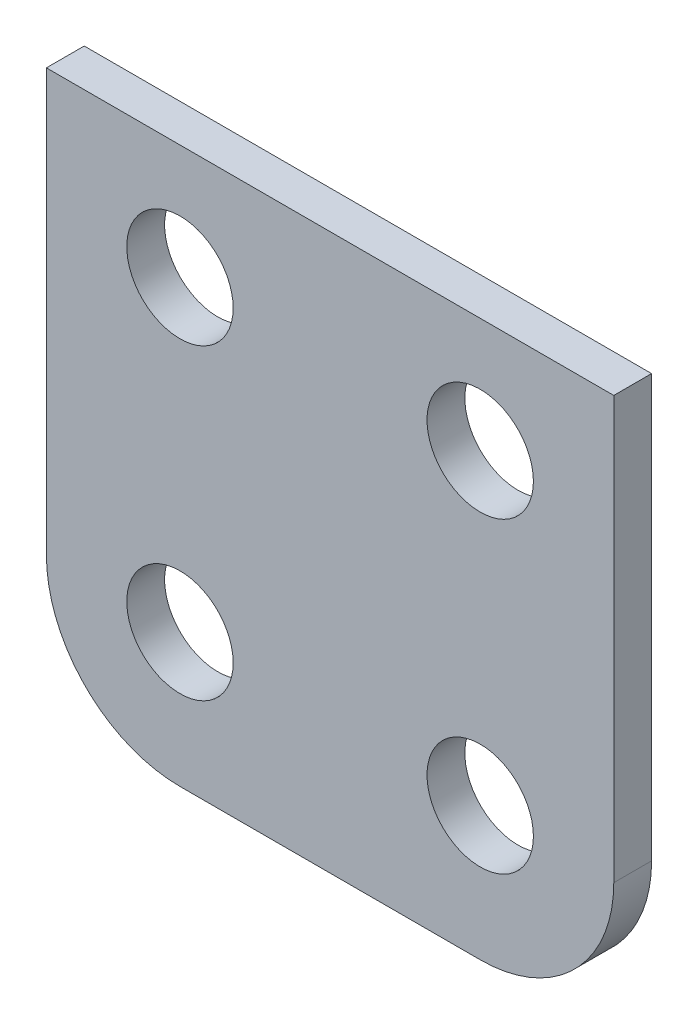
ISO-10303-21;
HEADER;
FILE_DESCRIPTION(('STEP AP214'),'2;1');
FILE_NAME('part.step','',(''),(''),'','','');
FILE_SCHEMA(('AUTOMOTIVE_DESIGN { 1 0 10303 214 1 1 1 1 }'));
ENDSEC;
DATA;
#1=APPLICATION_CONTEXT('core data for automotive mechanical design processes');
#2=APPLICATION_PROTOCOL_DEFINITION('international standard','automotive_design',2000,#1);
#3=PRODUCT_CONTEXT('',#1,'mechanical');
#4=PRODUCT('Part','Part','',(#3));
#5=PRODUCT_RELATED_PRODUCT_CATEGORY('part','',(#4));
#6=PRODUCT_DEFINITION_FORMATION('','',#4);
#7=PRODUCT_DEFINITION_CONTEXT('part definition',#1,'design');
#8=PRODUCT_DEFINITION('design','',#6,#7);
#9=PRODUCT_DEFINITION_SHAPE('','',#8);
#10=(LENGTH_UNIT() NAMED_UNIT(*) SI_UNIT(.MILLI.,.METRE.));
#11=(NAMED_UNIT(*) PLANE_ANGLE_UNIT() SI_UNIT($,.RADIAN.));
#12=(NAMED_UNIT(*) SI_UNIT($,.STERADIAN.) SOLID_ANGLE_UNIT());
#13=UNCERTAINTY_MEASURE_WITH_UNIT(LENGTH_MEASURE(1.E-05),#10,'distance_accuracy_value','');
#14=(GEOMETRIC_REPRESENTATION_CONTEXT(3) GLOBAL_UNCERTAINTY_ASSIGNED_CONTEXT((#13)) GLOBAL_UNIT_ASSIGNED_CONTEXT((#10,
#11,#12)) REPRESENTATION_CONTEXT('',''));
#15=CARTESIAN_POINT('',(0.,0.,0.));
#16=DIRECTION('',(0.,0.,1.));
#17=DIRECTION('',(1.,0.,0.));
#18=AXIS2_PLACEMENT_3D('',#15,#16,#17);
#19=CARTESIAN_POINT('',(24.,23.5,1.6));
#20=DIRECTION('',(0.,-1.,0.));
#21=DIRECTION('',(0.,0.,-1.));
#22=AXIS2_PLACEMENT_3D('',#19,#20,#21);
#23=PLANE('',#22);
#24=DIRECTION('',(-1.,0.,0.));
#25=VECTOR('',#24,1.);
#26=CARTESIAN_POINT('',(24.,23.5,0.));
#27=LINE('',#26,#25);
#28=CARTESIAN_POINT('',(24.,23.5,0.));
#29=VERTEX_POINT('',#28);
#30=CARTESIAN_POINT('',(0.,23.5,0.));
#31=VERTEX_POINT('',#30);
#32=EDGE_CURVE('E115',#29,#31,#27,.T.);
#33=ORIENTED_EDGE('',*,*,#32,.T.);
#34=DIRECTION('',(0.,0.,-1.));
#35=VECTOR('',#34,1.);
#36=CARTESIAN_POINT('',(0.,23.5,1.6));
#37=LINE('',#36,#35);
#38=CARTESIAN_POINT('',(0.,23.5,1.6));
#39=VERTEX_POINT('',#38);
#40=EDGE_CURVE('E11',#39,#31,#37,.T.);
#41=ORIENTED_EDGE('',*,*,#40,.F.);
#42=DIRECTION('',(-1.,0.,0.));
#43=VECTOR('',#42,1.);
#44=CARTESIAN_POINT('',(24.,23.5,1.6));
#45=LINE('',#44,#43);
#46=CARTESIAN_POINT('',(24.,23.5,1.6));
#47=VERTEX_POINT('',#46);
#48=EDGE_CURVE('E126',#47,#39,#45,.T.);
#49=ORIENTED_EDGE('',*,*,#48,.F.);
#50=DIRECTION('',(0.,0.,-1.));
#51=VECTOR('',#50,1.);
#52=CARTESIAN_POINT('',(24.,23.5,1.6));
#53=LINE('',#52,#51);
#54=EDGE_CURVE('E111',#47,#29,#53,.T.);
#55=ORIENTED_EDGE('',*,*,#54,.T.);
#56=EDGE_LOOP('',(#33,#41,#49,#55));
#57=FACE_BOUND('',#56,.T.);
#58=ADVANCED_FACE('F31',(#57),#23,.F.);
#59=CARTESIAN_POINT('',(0.,23.5,1.6));
#60=DIRECTION('',(1.,0.,0.));
#61=DIRECTION('',(0.,1.,0.));
#62=AXIS2_PLACEMENT_3D('',#59,#60,#61);
#63=PLANE('',#62);
#64=DIRECTION('',(0.,-1.,0.));
#65=VECTOR('',#64,1.);
#66=CARTESIAN_POINT('',(0.,23.5,0.));
#67=LINE('',#66,#65);
#68=CARTESIAN_POINT('',(0.,5.65,0.));
#69=VERTEX_POINT('',#68);
#70=EDGE_CURVE('E118',#31,#69,#67,.T.);
#71=ORIENTED_EDGE('',*,*,#70,.T.);
#72=DIRECTION('',(0.,0.,-1.));
#73=VECTOR('',#72,1.);
#74=CARTESIAN_POINT('',(0.,5.65,1.6));
#75=LINE('',#74,#73);
#76=CARTESIAN_POINT('',(0.,5.65,1.6));
#77=VERTEX_POINT('',#76);
#78=EDGE_CURVE('E39',#77,#69,#75,.T.);
#79=ORIENTED_EDGE('',*,*,#78,.F.);
#80=DIRECTION('',(0.,-1.,0.));
#81=VECTOR('',#80,1.);
#82=CARTESIAN_POINT('',(0.,23.5,1.6));
#83=LINE('',#82,#81);
#84=EDGE_CURVE('E84',#39,#77,#83,.T.);
#85=ORIENTED_EDGE('',*,*,#84,.F.);
#86=ORIENTED_EDGE('',*,*,#40,.T.);
#87=EDGE_LOOP('',(#71,#79,#85,#86));
#88=FACE_BOUND('',#87,.T.);
#89=ADVANCED_FACE('F151',(#88),#63,.F.);
#90=CARTESIAN_POINT('',(5.65,5.65,1.6));
#91=DIRECTION('',(0.,0.,-1.));
#92=DIRECTION('',(-1.,0.,0.));
#93=AXIS2_PLACEMENT_3D('',#90,#91,#92);
#94=CYLINDRICAL_SURFACE('',#93,5.65);
#95=CARTESIAN_POINT('',(5.65,5.65,0.));
#96=DIRECTION('',(0.,0.,1.));
#97=DIRECTION('',(-1.,0.,0.));
#98=AXIS2_PLACEMENT_3D('',#95,#96,#97);
#99=CIRCLE('',#98,5.65);
#100=CARTESIAN_POINT('',(5.65,0.,0.));
#101=VERTEX_POINT('',#100);
#102=EDGE_CURVE('E121',#69,#101,#99,.T.);
#103=ORIENTED_EDGE('',*,*,#102,.T.);
#104=DIRECTION('',(0.,0.,-1.));
#105=VECTOR('',#104,1.);
#106=CARTESIAN_POINT('',(5.65,0.,1.6));
#107=LINE('',#106,#105);
#108=CARTESIAN_POINT('',(5.65,0.,1.6));
#109=VERTEX_POINT('',#108);
#110=EDGE_CURVE('E106',#109,#101,#107,.T.);
#111=ORIENTED_EDGE('',*,*,#110,.F.);
#112=CARTESIAN_POINT('',(5.65,5.65,1.6));
#113=DIRECTION('',(0.,0.,1.));
#114=DIRECTION('',(-1.,0.,0.));
#115=AXIS2_PLACEMENT_3D('',#112,#113,#114);
#116=CIRCLE('',#115,5.65);
#117=EDGE_CURVE('E97',#77,#109,#116,.T.);
#118=ORIENTED_EDGE('',*,*,#117,.F.);
#119=ORIENTED_EDGE('',*,*,#78,.T.);
#120=EDGE_LOOP('',(#103,#111,#118,#119));
#121=FACE_BOUND('',#120,.T.);
#122=ADVANCED_FACE('F132',(#121),#94,.T.);
#123=CARTESIAN_POINT('',(5.65,0.,1.6));
#124=DIRECTION('',(0.,1.,0.));
#125=DIRECTION('',(0.,0.,1.));
#126=AXIS2_PLACEMENT_3D('',#123,#124,#125);
#127=PLANE('',#126);
#128=DIRECTION('',(1.,0.,0.));
#129=VECTOR('',#128,1.);
#130=CARTESIAN_POINT('',(5.65,0.,0.));
#131=LINE('',#130,#129);
#132=CARTESIAN_POINT('',(18.35,0.,0.));
#133=VERTEX_POINT('',#132);
#134=EDGE_CURVE('E105',#101,#133,#131,.T.);
#135=ORIENTED_EDGE('',*,*,#134,.T.);
#136=DIRECTION('',(0.,0.,-1.));
#137=VECTOR('',#136,1.);
#138=CARTESIAN_POINT('',(18.35,0.,1.6));
#139=LINE('',#138,#137);
#140=CARTESIAN_POINT('',(18.35,0.,1.6));
#141=VERTEX_POINT('',#140);
#142=EDGE_CURVE('E102',#141,#133,#139,.T.);
#143=ORIENTED_EDGE('',*,*,#142,.F.);
#144=DIRECTION('',(1.,0.,0.));
#145=VECTOR('',#144,1.);
#146=CARTESIAN_POINT('',(5.65,0.,1.6));
#147=LINE('',#146,#145);
#148=EDGE_CURVE('E91',#109,#141,#147,.T.);
#149=ORIENTED_EDGE('',*,*,#148,.F.);
#150=ORIENTED_EDGE('',*,*,#110,.T.);
#151=EDGE_LOOP('',(#135,#143,#149,#150));
#152=FACE_BOUND('',#151,.T.);
#153=ADVANCED_FACE('F103',(#152),#127,.F.);
#154=CARTESIAN_POINT('',(18.35,5.65,1.6));
#155=DIRECTION('',(0.,0.,-1.));
#156=DIRECTION('',(-1.,0.,0.));
#157=AXIS2_PLACEMENT_3D('',#154,#155,#156);
#158=CYLINDRICAL_SURFACE('',#157,5.65);
#159=CARTESIAN_POINT('',(18.35,5.65,0.));
#160=DIRECTION('',(0.,0.,1.));
#161=DIRECTION('',(-1.,0.,0.));
#162=AXIS2_PLACEMENT_3D('',#159,#160,#161);
#163=CIRCLE('',#162,5.65);
#164=CARTESIAN_POINT('',(24.,5.65,0.));
#165=VERTEX_POINT('',#164);
#166=EDGE_CURVE('E70',#133,#165,#163,.T.);
#167=ORIENTED_EDGE('',*,*,#166,.T.);
#168=DIRECTION('',(0.,0.,-1.));
#169=VECTOR('',#168,1.);
#170=CARTESIAN_POINT('',(24.,5.65,1.6));
#171=LINE('',#170,#169);
#172=CARTESIAN_POINT('',(24.,5.65,1.6));
#173=VERTEX_POINT('',#172);
#174=EDGE_CURVE('E107',#173,#165,#171,.T.);
#175=ORIENTED_EDGE('',*,*,#174,.F.);
#176=CARTESIAN_POINT('',(18.35,5.65,1.6));
#177=DIRECTION('',(0.,0.,1.));
#178=DIRECTION('',(-1.,0.,0.));
#179=AXIS2_PLACEMENT_3D('',#176,#177,#178);
#180=CIRCLE('',#179,5.65);
#181=EDGE_CURVE('E95',#141,#173,#180,.T.);
#182=ORIENTED_EDGE('',*,*,#181,.F.);
#183=ORIENTED_EDGE('',*,*,#142,.T.);
#184=EDGE_LOOP('',(#167,#175,#182,#183));
#185=FACE_BOUND('',#184,.T.);
#186=ADVANCED_FACE('F109',(#185),#158,.T.);
#187=CARTESIAN_POINT('',(24.,5.65,1.6));
#188=DIRECTION('',(-1.,0.,0.));
#189=DIRECTION('',(0.,-1.,0.));
#190=AXIS2_PLACEMENT_3D('',#187,#188,#189);
#191=PLANE('',#190);
#192=DIRECTION('',(0.,1.,0.));
#193=VECTOR('',#192,1.);
#194=CARTESIAN_POINT('',(24.,5.65,0.));
#195=LINE('',#194,#193);
#196=EDGE_CURVE('E76',#165,#29,#195,.T.);
#197=ORIENTED_EDGE('',*,*,#196,.T.);
#198=ORIENTED_EDGE('',*,*,#54,.F.);
#199=DIRECTION('',(0.,1.,0.));
#200=VECTOR('',#199,1.);
#201=CARTESIAN_POINT('',(24.,5.65,1.6));
#202=LINE('',#201,#200);
#203=EDGE_CURVE('E47',#173,#47,#202,.T.);
#204=ORIENTED_EDGE('',*,*,#203,.F.);
#205=ORIENTED_EDGE('',*,*,#174,.T.);
#206=EDGE_LOOP('',(#197,#198,#204,#205));
#207=FACE_BOUND('',#206,.T.);
#208=ADVANCED_FACE('F139',(#207),#191,.F.);
#209=CARTESIAN_POINT('',(5.65,5.65,1.6));
#210=DIRECTION('',(0.,0.,-1.));
#211=DIRECTION('',(-1.,0.,0.));
#212=AXIS2_PLACEMENT_3D('',#209,#210,#211);
#213=PLANE('',#212);
#214=CARTESIAN_POINT('',(5.65,5.65,1.6));
#215=DIRECTION('',(0.,0.,1.));
#216=DIRECTION('',(1.,0.,0.));
#217=AXIS2_PLACEMENT_3D('',#214,#215,#216);
#218=CIRCLE('',#217,2.24999999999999);
#219=CARTESIAN_POINT('',(7.89999999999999,5.65,1.6));
#220=VERTEX_POINT('',#219);
#221=EDGE_CURVE('E237',#220,#220,#218,.T.);
#222=ORIENTED_EDGE('',*,*,#221,.F.);
#223=EDGE_LOOP('',(#222));
#224=FACE_BOUND('',#223,.T.);
#225=CARTESIAN_POINT('',(18.35,5.65,1.6));
#226=DIRECTION('',(0.,0.,1.));
#227=DIRECTION('',(1.,0.,0.));
#228=AXIS2_PLACEMENT_3D('',#225,#226,#227);
#229=CIRCLE('',#228,2.24999999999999);
#230=CARTESIAN_POINT('',(20.6,5.65,1.6));
#231=VERTEX_POINT('',#230);
#232=EDGE_CURVE('E239',#231,#231,#229,.T.);
#233=ORIENTED_EDGE('',*,*,#232,.F.);
#234=EDGE_LOOP('',(#233));
#235=FACE_BOUND('',#234,.T.);
#236=CARTESIAN_POINT('',(18.35,18.65,1.6));
#237=DIRECTION('',(0.,0.,1.));
#238=DIRECTION('',(1.,0.,0.));
#239=AXIS2_PLACEMENT_3D('',#236,#237,#238);
#240=CIRCLE('',#239,2.24999999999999);
#241=CARTESIAN_POINT('',(20.6,18.65,1.6));
#242=VERTEX_POINT('',#241);
#243=EDGE_CURVE('E247',#242,#242,#240,.T.);
#244=ORIENTED_EDGE('',*,*,#243,.F.);
#245=EDGE_LOOP('',(#244));
#246=FACE_BOUND('',#245,.T.);
#247=CARTESIAN_POINT('',(5.65,18.65,1.6));
#248=DIRECTION('',(0.,0.,1.));
#249=DIRECTION('',(1.,0.,0.));
#250=AXIS2_PLACEMENT_3D('',#247,#248,#249);
#251=CIRCLE('',#250,2.24999999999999);
#252=CARTESIAN_POINT('',(7.89999999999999,18.65,1.6));
#253=VERTEX_POINT('',#252);
#254=EDGE_CURVE('E253',#253,#253,#251,.T.);
#255=ORIENTED_EDGE('',*,*,#254,.F.);
#256=EDGE_LOOP('',(#255));
#257=FACE_BOUND('',#256,.T.);
#258=ORIENTED_EDGE('',*,*,#48,.T.);
#259=ORIENTED_EDGE('',*,*,#84,.T.);
#260=ORIENTED_EDGE('',*,*,#117,.T.);
#261=ORIENTED_EDGE('',*,*,#148,.T.);
#262=ORIENTED_EDGE('',*,*,#181,.T.);
#263=ORIENTED_EDGE('',*,*,#203,.T.);
#264=EDGE_LOOP('',(#258,#259,#260,#261,#262,#263));
#265=FACE_BOUND('',#264,.T.);
#266=ADVANCED_FACE('F93',(#224,#235,#246,#257,#265),#213,.F.);
#267=CARTESIAN_POINT('',(5.65,5.65,0.));
#268=DIRECTION('',(0.,0.,-1.));
#269=DIRECTION('',(-1.,0.,0.));
#270=AXIS2_PLACEMENT_3D('',#267,#268,#269);
#271=PLANE('',#270);
#272=CARTESIAN_POINT('',(5.65,5.65,0.));
#273=DIRECTION('',(0.,0.,1.));
#274=DIRECTION('',(1.,0.,0.));
#275=AXIS2_PLACEMENT_3D('',#272,#273,#274);
#276=CIRCLE('',#275,2.24999999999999);
#277=CARTESIAN_POINT('',(7.89999999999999,5.65,0.));
#278=VERTEX_POINT('',#277);
#279=EDGE_CURVE('E234',#278,#278,#276,.T.);
#280=ORIENTED_EDGE('',*,*,#279,.T.);
#281=EDGE_LOOP('',(#280));
#282=FACE_BOUND('',#281,.T.);
#283=CARTESIAN_POINT('',(18.35,5.65,0.));
#284=DIRECTION('',(0.,0.,1.));
#285=DIRECTION('',(1.,0.,0.));
#286=AXIS2_PLACEMENT_3D('',#283,#284,#285);
#287=CIRCLE('',#286,2.24999999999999);
#288=CARTESIAN_POINT('',(20.6,5.65,0.));
#289=VERTEX_POINT('',#288);
#290=EDGE_CURVE('E244',#289,#289,#287,.T.);
#291=ORIENTED_EDGE('',*,*,#290,.T.);
#292=EDGE_LOOP('',(#291));
#293=FACE_BOUND('',#292,.T.);
#294=CARTESIAN_POINT('',(18.35,18.65,0.));
#295=DIRECTION('',(0.,0.,1.));
#296=DIRECTION('',(1.,0.,0.));
#297=AXIS2_PLACEMENT_3D('',#294,#295,#296);
#298=CIRCLE('',#297,2.24999999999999);
#299=CARTESIAN_POINT('',(20.6,18.65,0.));
#300=VERTEX_POINT('',#299);
#301=EDGE_CURVE('E250',#300,#300,#298,.T.);
#302=ORIENTED_EDGE('',*,*,#301,.T.);
#303=EDGE_LOOP('',(#302));
#304=FACE_BOUND('',#303,.T.);
#305=CARTESIAN_POINT('',(5.65,18.65,0.));
#306=DIRECTION('',(0.,0.,1.));
#307=DIRECTION('',(1.,0.,0.));
#308=AXIS2_PLACEMENT_3D('',#305,#306,#307);
#309=CIRCLE('',#308,2.24999999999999);
#310=CARTESIAN_POINT('',(7.89999999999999,18.65,0.));
#311=VERTEX_POINT('',#310);
#312=EDGE_CURVE('E119',#311,#311,#309,.T.);
#313=ORIENTED_EDGE('',*,*,#312,.T.);
#314=EDGE_LOOP('',(#313));
#315=FACE_BOUND('',#314,.T.);
#316=ORIENTED_EDGE('',*,*,#32,.F.);
#317=ORIENTED_EDGE('',*,*,#196,.F.);
#318=ORIENTED_EDGE('',*,*,#166,.F.);
#319=ORIENTED_EDGE('',*,*,#134,.F.);
#320=ORIENTED_EDGE('',*,*,#102,.F.);
#321=ORIENTED_EDGE('',*,*,#70,.F.);
#322=EDGE_LOOP('',(#316,#317,#318,#319,#320,#321));
#323=FACE_BOUND('',#322,.T.);
#324=ADVANCED_FACE('F135',(#282,#293,#304,#315,#323),#271,.T.);
#325=CARTESIAN_POINT('',(5.65,18.65,1.6));
#326=DIRECTION('',(0.,0.,1.));
#327=DIRECTION('',(1.,0.,0.));
#328=AXIS2_PLACEMENT_3D('',#325,#326,#327);
#329=CYLINDRICAL_SURFACE('',#328,2.24999999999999);
#330=ORIENTED_EDGE('',*,*,#312,.F.);
#331=EDGE_LOOP('',(#330));
#332=FACE_BOUND('',#331,.T.);
#333=ORIENTED_EDGE('',*,*,#254,.T.);
#334=EDGE_LOOP('',(#333));
#335=FACE_BOUND('',#334,.T.);
#336=ADVANCED_FACE('F188',(#332,#335),#329,.F.);
#337=CARTESIAN_POINT('',(18.35,18.65,1.6));
#338=DIRECTION('',(0.,0.,1.));
#339=DIRECTION('',(1.,0.,0.));
#340=AXIS2_PLACEMENT_3D('',#337,#338,#339);
#341=CYLINDRICAL_SURFACE('',#340,2.24999999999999);
#342=ORIENTED_EDGE('',*,*,#301,.F.);
#343=EDGE_LOOP('',(#342));
#344=FACE_BOUND('',#343,.T.);
#345=ORIENTED_EDGE('',*,*,#243,.T.);
#346=EDGE_LOOP('',(#345));
#347=FACE_BOUND('',#346,.T.);
#348=ADVANCED_FACE('F197',(#344,#347),#341,.F.);
#349=CARTESIAN_POINT('',(18.35,5.65,1.6));
#350=DIRECTION('',(0.,0.,1.));
#351=DIRECTION('',(1.,0.,0.));
#352=AXIS2_PLACEMENT_3D('',#349,#350,#351);
#353=CYLINDRICAL_SURFACE('',#352,2.24999999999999);
#354=ORIENTED_EDGE('',*,*,#290,.F.);
#355=EDGE_LOOP('',(#354));
#356=FACE_BOUND('',#355,.T.);
#357=ORIENTED_EDGE('',*,*,#232,.T.);
#358=EDGE_LOOP('',(#357));
#359=FACE_BOUND('',#358,.T.);
#360=ADVANCED_FACE('F207',(#356,#359),#353,.F.);
#361=CARTESIAN_POINT('',(5.65,5.65,1.6));
#362=DIRECTION('',(0.,0.,1.));
#363=DIRECTION('',(1.,0.,0.));
#364=AXIS2_PLACEMENT_3D('',#361,#362,#363);
#365=CYLINDRICAL_SURFACE('',#364,2.24999999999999);
#366=ORIENTED_EDGE('',*,*,#279,.F.);
#367=EDGE_LOOP('',(#366));
#368=FACE_BOUND('',#367,.T.);
#369=ORIENTED_EDGE('',*,*,#221,.T.);
#370=EDGE_LOOP('',(#369));
#371=FACE_BOUND('',#370,.T.);
#372=ADVANCED_FACE('F217',(#368,#371),#365,.F.);
#373=CLOSED_SHELL('',(#58,#89,#122,#153,#186,#208,#266,#324,#336,#348,#360,#372));
#374=MANIFOLD_SOLID_BREP('B2',#373);
#375=ADVANCED_BREP_SHAPE_REPRESENTATION('',(#18,#374),#14);
#376=SHAPE_DEFINITION_REPRESENTATION(#9,#375);
ENDSEC;
END-ISO-10303-21;
